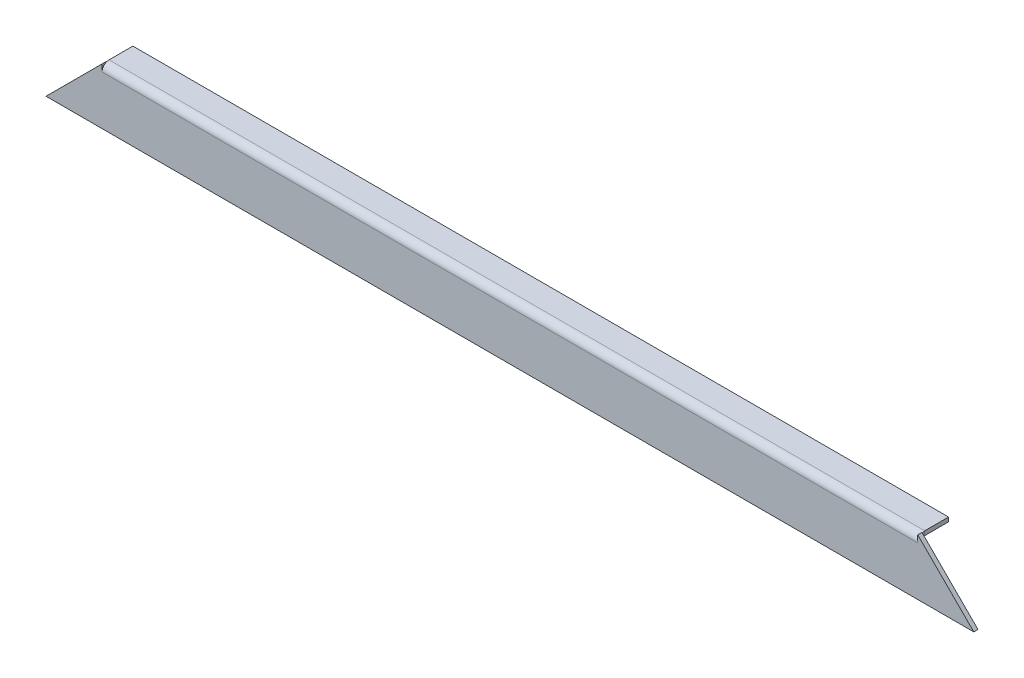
ISO-10303-21;
HEADER;
FILE_DESCRIPTION(('STEP AP214'),'2;1');
FILE_NAME('part.step','',(''),(''),'','','');
FILE_SCHEMA(('AUTOMOTIVE_DESIGN { 1 0 10303 214 1 1 1 1 }'));
ENDSEC;
DATA;
#1=APPLICATION_CONTEXT('core data for automotive mechanical design processes');
#2=APPLICATION_PROTOCOL_DEFINITION('international standard','automotive_design',2000,#1);
#3=PRODUCT_CONTEXT('',#1,'mechanical');
#4=PRODUCT('Part','Part','',(#3));
#5=PRODUCT_RELATED_PRODUCT_CATEGORY('part','',(#4));
#6=PRODUCT_DEFINITION_FORMATION('','',#4);
#7=PRODUCT_DEFINITION_CONTEXT('part definition',#1,'design');
#8=PRODUCT_DEFINITION('design','',#6,#7);
#9=PRODUCT_DEFINITION_SHAPE('','',#8);
#10=(LENGTH_UNIT() NAMED_UNIT(*) SI_UNIT(.MILLI.,.METRE.));
#11=(NAMED_UNIT(*) PLANE_ANGLE_UNIT() SI_UNIT($,.RADIAN.));
#12=(NAMED_UNIT(*) SI_UNIT($,.STERADIAN.) SOLID_ANGLE_UNIT());
#13=UNCERTAINTY_MEASURE_WITH_UNIT(LENGTH_MEASURE(1.E-05),#10,'distance_accuracy_value','');
#14=(GEOMETRIC_REPRESENTATION_CONTEXT(3) GLOBAL_UNCERTAINTY_ASSIGNED_CONTEXT((#13)) GLOBAL_UNIT_ASSIGNED_CONTEXT((#10,
#11,#12)) REPRESENTATION_CONTEXT('',''));
#15=CARTESIAN_POINT('',(0.,0.,0.));
#16=DIRECTION('',(0.,0.,1.));
#17=DIRECTION('',(1.,0.,0.));
#18=AXIS2_PLACEMENT_3D('',#15,#16,#17);
#19=CARTESIAN_POINT('',(145.5,-689.5,0.));
#20=DIRECTION('',(-1.,0.,0.));
#21=DIRECTION('',(0.,0.,1.));
#22=AXIS2_PLACEMENT_3D('',#19,#20,#21);
#23=PLANE('',#22);
#24=DIRECTION('',(0.,-1.,0.));
#25=VECTOR('',#24,1.);
#26=CARTESIAN_POINT('',(145.5,-689.5,0.));
#27=LINE('',#26,#25);
#28=CARTESIAN_POINT('',(145.5,-689.5,0.));
#29=VERTEX_POINT('',#28);
#30=CARTESIAN_POINT('',(145.5,-689.708712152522,0.));
#31=VERTEX_POINT('',#30);
#32=EDGE_CURVE('E206',#29,#31,#27,.T.);
#33=ORIENTED_EDGE('',*,*,#32,.T.);
#34=CARTESIAN_POINT('',(145.5,-692.,-1.));
#35=DIRECTION('',(1.,0.,0.));
#36=DIRECTION('',(0.,0.,-1.));
#37=AXIS2_PLACEMENT_3D('',#34,#35,#36);
#38=CIRCLE('',#37,2.49999999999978);
#39=CARTESIAN_POINT('',(145.5,-692.,1.5));
#40=VERTEX_POINT('',#39);
#41=EDGE_CURVE('E13',#31,#40,#38,.T.);
#42=ORIENTED_EDGE('',*,*,#41,.T.);
#43=DIRECTION('',(0.,-1.,0.));
#44=VECTOR('',#43,1.);
#45=CARTESIAN_POINT('',(145.5,0.,1.5));
#46=LINE('',#45,#44);
#47=CARTESIAN_POINT('',(145.5,-689.5,1.5));
#48=VERTEX_POINT('',#47);
#49=EDGE_CURVE('E213',#48,#40,#46,.T.);
#50=ORIENTED_EDGE('',*,*,#49,.F.);
#51=DIRECTION('',(0.,0.,-1.));
#52=VECTOR('',#51,1.);
#53=CARTESIAN_POINT('',(145.5,-689.5,1.5));
#54=LINE('',#53,#52);
#55=EDGE_CURVE('E233',#48,#29,#54,.T.);
#56=ORIENTED_EDGE('',*,*,#55,.T.);
#57=EDGE_LOOP('',(#33,#42,#50,#56));
#58=FACE_BOUND('',#57,.T.);
#59=ADVANCED_FACE('F58',(#58),#23,.T.);
#60=CARTESIAN_POINT('',(-145.499999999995,-692.,-2.22044604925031E-13));
#61=DIRECTION('',(1.,0.,0.));
#62=DIRECTION('',(0.,0.,-1.));
#63=AXIS2_PLACEMENT_3D('',#60,#61,#62);
#64=PLANE('',#63);
#65=DIRECTION('',(0.,1.,0.));
#66=VECTOR('',#65,1.);
#67=CARTESIAN_POINT('',(-145.499999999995,0.,1.5));
#68=LINE('',#67,#66);
#69=CARTESIAN_POINT('',(-145.499999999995,-692.,1.5));
#70=VERTEX_POINT('',#69);
#71=CARTESIAN_POINT('',(-145.499999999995,-689.5,1.5));
#72=VERTEX_POINT('',#71);
#73=EDGE_CURVE('E208',#70,#72,#68,.T.);
#74=ORIENTED_EDGE('',*,*,#73,.F.);
#75=CARTESIAN_POINT('',(-145.499999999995,-692.,-1.));
#76=DIRECTION('',(1.,0.,0.));
#77=DIRECTION('',(0.,0.,-1.));
#78=AXIS2_PLACEMENT_3D('',#75,#76,#77);
#79=CIRCLE('',#78,2.49999999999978);
#80=CARTESIAN_POINT('',(-145.499999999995,-689.708712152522,0.));
#81=VERTEX_POINT('',#80);
#82=EDGE_CURVE('E196',#70,#81,#79,.F.);
#83=ORIENTED_EDGE('',*,*,#82,.T.);
#84=DIRECTION('',(0.,1.,0.));
#85=VECTOR('',#84,1.);
#86=CARTESIAN_POINT('',(-145.499999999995,-692.,-2.22044604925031E-13));
#87=LINE('',#86,#85);
#88=CARTESIAN_POINT('',(-145.499999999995,-689.5,0.));
#89=VERTEX_POINT('',#88);
#90=EDGE_CURVE('E198',#81,#89,#87,.T.);
#91=ORIENTED_EDGE('',*,*,#90,.T.);
#92=DIRECTION('',(0.,0.,-1.));
#93=VECTOR('',#92,1.);
#94=CARTESIAN_POINT('',(-145.499999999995,-689.5,1.5));
#95=LINE('',#94,#93);
#96=EDGE_CURVE('E224',#72,#89,#95,.T.);
#97=ORIENTED_EDGE('',*,*,#96,.F.);
#98=EDGE_LOOP('',(#74,#83,#91,#97));
#99=FACE_BOUND('',#98,.T.);
#100=ADVANCED_FACE('F257',(#99),#64,.T.);
#101=CARTESIAN_POINT('',(0.,0.,1.5));
#102=DIRECTION('',(0.,0.,1.));
#103=DIRECTION('',(1.,0.,0.));
#104=AXIS2_PLACEMENT_3D('',#101,#102,#103);
#105=PLANE('',#104);
#106=DIRECTION('',(-0.707106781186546,0.707106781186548,0.));
#107=VECTOR('',#106,1.);
#108=CARTESIAN_POINT('',(145.5,-689.5,1.5));
#109=LINE('',#108,#107);
#110=CARTESIAN_POINT('',(165.5,-709.5,1.5));
#111=VERTEX_POINT('',#110);
#112=EDGE_CURVE('E222',#111,#48,#109,.T.);
#113=ORIENTED_EDGE('',*,*,#112,.T.);
#114=ORIENTED_EDGE('',*,*,#49,.T.);
#115=DIRECTION('',(1.,0.,0.));
#116=VECTOR('',#115,1.);
#117=CARTESIAN_POINT('',(145.5,-691.999999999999,1.49999999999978));
#118=LINE('',#117,#116);
#119=EDGE_CURVE('E150',#40,#70,#118,.F.);
#120=ORIENTED_EDGE('',*,*,#119,.T.);
#121=ORIENTED_EDGE('',*,*,#73,.T.);
#122=DIRECTION('',(-0.707106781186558,-0.707106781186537,0.));
#123=VECTOR('',#122,1.);
#124=CARTESIAN_POINT('',(-145.499999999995,-689.5,1.5));
#125=LINE('',#124,#123);
#126=CARTESIAN_POINT('',(-165.499999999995,-709.5,1.5));
#127=VERTEX_POINT('',#126);
#128=EDGE_CURVE('E216',#72,#127,#125,.T.);
#129=ORIENTED_EDGE('',*,*,#128,.T.);
#130=DIRECTION('',(1.,0.,0.));
#131=VECTOR('',#130,1.);
#132=CARTESIAN_POINT('',(-165.499999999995,-709.5,1.5));
#133=LINE('',#132,#131);
#134=EDGE_CURVE('E219',#127,#111,#133,.T.);
#135=ORIENTED_EDGE('',*,*,#134,.T.);
#136=EDGE_LOOP('',(#113,#114,#120,#121,#129,#135));
#137=FACE_BOUND('',#136,.T.);
#138=ADVANCED_FACE('F253',(#137),#105,.T.);
#139=CARTESIAN_POINT('',(0.,0.,0.));
#140=DIRECTION('',(0.,0.,1.));
#141=DIRECTION('',(1.,0.,0.));
#142=AXIS2_PLACEMENT_3D('',#139,#140,#141);
#143=PLANE('',#142);
#144=ORIENTED_EDGE('',*,*,#32,.F.);
#145=DIRECTION('',(-0.707106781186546,0.707106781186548,0.));
#146=VECTOR('',#145,1.);
#147=CARTESIAN_POINT('',(145.5,-689.5,0.));
#148=LINE('',#147,#146);
#149=CARTESIAN_POINT('',(165.5,-709.5,0.));
#150=VERTEX_POINT('',#149);
#151=EDGE_CURVE('E220',#150,#29,#148,.T.);
#152=ORIENTED_EDGE('',*,*,#151,.F.);
#153=DIRECTION('',(1.,0.,0.));
#154=VECTOR('',#153,1.);
#155=CARTESIAN_POINT('',(-165.499999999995,-709.5,0.));
#156=LINE('',#155,#154);
#157=CARTESIAN_POINT('',(-165.499999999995,-709.5,0.));
#158=VERTEX_POINT('',#157);
#159=EDGE_CURVE('E227',#158,#150,#156,.T.);
#160=ORIENTED_EDGE('',*,*,#159,.F.);
#161=DIRECTION('',(-0.707106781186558,-0.707106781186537,0.));
#162=VECTOR('',#161,1.);
#163=CARTESIAN_POINT('',(-145.499999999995,-689.5,0.));
#164=LINE('',#163,#162);
#165=EDGE_CURVE('E215',#89,#158,#164,.T.);
#166=ORIENTED_EDGE('',*,*,#165,.F.);
#167=ORIENTED_EDGE('',*,*,#90,.F.);
#168=CARTESIAN_POINT('',(-145.499999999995,-692.,0.));
#169=VERTEX_POINT('',#168);
#170=EDGE_CURVE('E209',#169,#81,#87,.T.);
#171=ORIENTED_EDGE('',*,*,#170,.F.);
#172=DIRECTION('',(1.,0.,0.));
#173=VECTOR('',#172,1.);
#174=CARTESIAN_POINT('',(145.5,-692.,-2.22044604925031E-13));
#175=LINE('',#174,#173);
#176=CARTESIAN_POINT('',(145.5,-692.,0.));
#177=VERTEX_POINT('',#176);
#178=EDGE_CURVE('E202',#177,#169,#175,.F.);
#179=ORIENTED_EDGE('',*,*,#178,.F.);
#180=EDGE_CURVE('E75',#31,#177,#27,.T.);
#181=ORIENTED_EDGE('',*,*,#180,.F.);
#182=EDGE_LOOP('',(#144,#152,#160,#166,#167,#171,#179,#181));
#183=FACE_BOUND('',#182,.T.);
#184=ADVANCED_FACE('F249',(#183),#143,.F.);
#185=CARTESIAN_POINT('',(-145.499999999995,-689.5,1.5));
#186=DIRECTION('',(0.707106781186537,-0.707106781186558,0.));
#187=DIRECTION('',(0.707106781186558,0.707106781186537,0.));
#188=AXIS2_PLACEMENT_3D('',#185,#186,#187);
#189=PLANE('',#188);
#190=ORIENTED_EDGE('',*,*,#165,.T.);
#191=DIRECTION('',(0.,0.,-1.));
#192=VECTOR('',#191,1.);
#193=CARTESIAN_POINT('',(-165.499999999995,-709.5,1.5));
#194=LINE('',#193,#192);
#195=EDGE_CURVE('E62',#127,#158,#194,.T.);
#196=ORIENTED_EDGE('',*,*,#195,.F.);
#197=ORIENTED_EDGE('',*,*,#128,.F.);
#198=ORIENTED_EDGE('',*,*,#96,.T.);
#199=EDGE_LOOP('',(#190,#196,#197,#198));
#200=FACE_BOUND('',#199,.T.);
#201=ADVANCED_FACE('F60',(#200),#189,.F.);
#202=CARTESIAN_POINT('',(-165.499999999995,-709.5,1.5));
#203=DIRECTION('',(0.,1.,0.));
#204=DIRECTION('',(0.,0.,1.));
#205=AXIS2_PLACEMENT_3D('',#202,#203,#204);
#206=PLANE('',#205);
#207=ORIENTED_EDGE('',*,*,#159,.T.);
#208=DIRECTION('',(0.,0.,-1.));
#209=VECTOR('',#208,1.);
#210=CARTESIAN_POINT('',(165.5,-709.5,1.5));
#211=LINE('',#210,#209);
#212=EDGE_CURVE('E235',#111,#150,#211,.T.);
#213=ORIENTED_EDGE('',*,*,#212,.F.);
#214=ORIENTED_EDGE('',*,*,#134,.F.);
#215=ORIENTED_EDGE('',*,*,#195,.T.);
#216=EDGE_LOOP('',(#207,#213,#214,#215));
#217=FACE_BOUND('',#216,.T.);
#218=ADVANCED_FACE('F244',(#217),#206,.F.);
#219=CARTESIAN_POINT('',(145.5,-689.5,1.5));
#220=DIRECTION('',(-0.707106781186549,-0.707106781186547,0.));
#221=DIRECTION('',(0.707106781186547,-0.707106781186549,0.));
#222=AXIS2_PLACEMENT_3D('',#219,#220,#221);
#223=PLANE('',#222);
#224=ORIENTED_EDGE('',*,*,#151,.T.);
#225=ORIENTED_EDGE('',*,*,#55,.F.);
#226=ORIENTED_EDGE('',*,*,#112,.F.);
#227=ORIENTED_EDGE('',*,*,#212,.T.);
#228=EDGE_LOOP('',(#224,#225,#226,#227));
#229=FACE_BOUND('',#228,.T.);
#230=ADVANCED_FACE('F251',(#229),#223,.F.);
#231=CARTESIAN_POINT('',(-145.499999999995,-692.,-1.));
#232=DIRECTION('',(-1.,0.,0.));
#233=DIRECTION('',(0.,0.,1.));
#234=AXIS2_PLACEMENT_3D('',#231,#232,#233);
#235=PLANE('',#234);
#236=CARTESIAN_POINT('',(-145.499999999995,-692.,-1.));
#237=DIRECTION('',(1.,0.,0.));
#238=DIRECTION('',(0.,0.,-1.));
#239=AXIS2_PLACEMENT_3D('',#236,#237,#238);
#240=CIRCLE('',#239,0.999999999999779);
#241=CARTESIAN_POINT('',(-145.499999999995,-691.,-1.));
#242=VERTEX_POINT('',#241);
#243=EDGE_CURVE('E151',#169,#242,#240,.F.);
#244=ORIENTED_EDGE('',*,*,#243,.F.);
#245=ORIENTED_EDGE('',*,*,#170,.T.);
#246=CARTESIAN_POINT('',(-145.499999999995,-689.5,-1.));
#247=VERTEX_POINT('',#246);
#248=EDGE_CURVE('E195',#81,#247,#79,.F.);
#249=ORIENTED_EDGE('',*,*,#248,.T.);
#250=DIRECTION('',(0.,1.,0.));
#251=VECTOR('',#250,1.);
#252=CARTESIAN_POINT('',(-145.499999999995,-689.5,-1.));
#253=LINE('',#252,#251);
#254=EDGE_CURVE('E192',#242,#247,#253,.T.);
#255=ORIENTED_EDGE('',*,*,#254,.F.);
#256=EDGE_LOOP('',(#244,#245,#249,#255));
#257=FACE_BOUND('',#256,.T.);
#258=ADVANCED_FACE('F260',(#257),#235,.T.);
#259=CARTESIAN_POINT('',(145.5,-692.,-1.));
#260=DIRECTION('',(-1.,0.,0.));
#261=DIRECTION('',(0.,0.,1.));
#262=AXIS2_PLACEMENT_3D('',#259,#260,#261);
#263=PLANE('',#262);
#264=CARTESIAN_POINT('',(145.5,-689.5,-1.));
#265=VERTEX_POINT('',#264);
#266=EDGE_CURVE('E68',#265,#31,#38,.T.);
#267=ORIENTED_EDGE('',*,*,#266,.T.);
#268=ORIENTED_EDGE('',*,*,#180,.T.);
#269=CARTESIAN_POINT('',(145.5,-692.,-1.));
#270=DIRECTION('',(1.,0.,0.));
#271=DIRECTION('',(0.,0.,-1.));
#272=AXIS2_PLACEMENT_3D('',#269,#270,#271);
#273=CIRCLE('',#272,0.999999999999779);
#274=CARTESIAN_POINT('',(145.5,-691.,-1.));
#275=VERTEX_POINT('',#274);
#276=EDGE_CURVE('E157',#275,#177,#273,.T.);
#277=ORIENTED_EDGE('',*,*,#276,.F.);
#278=DIRECTION('',(0.,1.,0.));
#279=VECTOR('',#278,1.);
#280=CARTESIAN_POINT('',(145.5,-691.,-1.));
#281=LINE('',#280,#279);
#282=EDGE_CURVE('E154',#275,#265,#281,.T.);
#283=ORIENTED_EDGE('',*,*,#282,.T.);
#284=EDGE_LOOP('',(#267,#268,#277,#283));
#285=FACE_BOUND('',#284,.T.);
#286=ADVANCED_FACE('F155',(#285),#263,.F.);
#287=CARTESIAN_POINT('',(145.5,-692.,-1.));
#288=DIRECTION('',(1.,0.,0.));
#289=DIRECTION('',(0.,1.,0.));
#290=AXIS2_PLACEMENT_3D('',#287,#288,#289);
#291=CYLINDRICAL_SURFACE('',#290,2.49999999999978);
#292=ORIENTED_EDGE('',*,*,#119,.F.);
#293=ORIENTED_EDGE('',*,*,#41,.F.);
#294=ORIENTED_EDGE('',*,*,#266,.F.);
#295=DIRECTION('',(1.,0.,0.));
#296=VECTOR('',#295,1.);
#297=CARTESIAN_POINT('',(7.89173995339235E-13,-689.5,-1.));
#298=LINE('',#297,#296);
#299=EDGE_CURVE('E147',#247,#265,#298,.T.);
#300=ORIENTED_EDGE('',*,*,#299,.F.);
#301=ORIENTED_EDGE('',*,*,#248,.F.);
#302=ORIENTED_EDGE('',*,*,#82,.F.);
#303=EDGE_LOOP('',(#292,#293,#294,#300,#301,#302));
#304=FACE_BOUND('',#303,.T.);
#305=ADVANCED_FACE('F144',(#304),#291,.T.);
#306=CARTESIAN_POINT('',(145.5,-692.,-1.));
#307=DIRECTION('',(1.,0.,0.));
#308=DIRECTION('',(0.,1.,0.));
#309=AXIS2_PLACEMENT_3D('',#306,#307,#308);
#310=CYLINDRICAL_SURFACE('',#309,0.999999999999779);
#311=ORIENTED_EDGE('',*,*,#178,.T.);
#312=ORIENTED_EDGE('',*,*,#243,.T.);
#313=DIRECTION('',(-1.,0.,0.));
#314=VECTOR('',#313,1.);
#315=CARTESIAN_POINT('',(-145.499999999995,-691.,-1.));
#316=LINE('',#315,#314);
#317=EDGE_CURVE('E162',#242,#275,#316,.F.);
#318=ORIENTED_EDGE('',*,*,#317,.T.);
#319=ORIENTED_EDGE('',*,*,#276,.T.);
#320=EDGE_LOOP('',(#311,#312,#318,#319));
#321=FACE_BOUND('',#320,.T.);
#322=ADVANCED_FACE('F262',(#321),#310,.F.);
#323=CARTESIAN_POINT('',(145.5,-689.5,0.));
#324=DIRECTION('',(1.,0.,0.));
#325=DIRECTION('',(0.,1.,0.));
#326=AXIS2_PLACEMENT_3D('',#323,#324,#325);
#327=PLANE('',#326);
#328=DIRECTION('',(0.,0.,1.));
#329=VECTOR('',#328,1.);
#330=CARTESIAN_POINT('',(145.5,-689.5,0.));
#331=LINE('',#330,#329);
#332=CARTESIAN_POINT('',(145.5,-689.5,-9.5));
#333=VERTEX_POINT('',#332);
#334=EDGE_CURVE('E169',#333,#265,#331,.T.);
#335=ORIENTED_EDGE('',*,*,#334,.T.);
#336=ORIENTED_EDGE('',*,*,#282,.F.);
#337=DIRECTION('',(0.,0.,-1.));
#338=VECTOR('',#337,1.);
#339=CARTESIAN_POINT('',(145.5,-691.,0.));
#340=LINE('',#339,#338);
#341=CARTESIAN_POINT('',(145.5,-691.,-9.50000000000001));
#342=VERTEX_POINT('',#341);
#343=EDGE_CURVE('E185',#342,#275,#340,.F.);
#344=ORIENTED_EDGE('',*,*,#343,.F.);
#345=DIRECTION('',(0.,-1.,0.));
#346=VECTOR('',#345,1.);
#347=CARTESIAN_POINT('',(145.5,-689.5,-9.5));
#348=LINE('',#347,#346);
#349=EDGE_CURVE('E174',#333,#342,#348,.T.);
#350=ORIENTED_EDGE('',*,*,#349,.F.);
#351=EDGE_LOOP('',(#335,#336,#344,#350));
#352=FACE_BOUND('',#351,.T.);
#353=ADVANCED_FACE('F173',(#352),#327,.T.);
#354=CARTESIAN_POINT('',(-145.499999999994,-689.5,-9.5));
#355=DIRECTION('',(-1.,0.,0.));
#356=DIRECTION('',(0.,0.,1.));
#357=AXIS2_PLACEMENT_3D('',#354,#355,#356);
#358=PLANE('',#357);
#359=DIRECTION('',(0.,0.,1.));
#360=VECTOR('',#359,1.);
#361=CARTESIAN_POINT('',(-145.499999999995,-691.,-1.19027594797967E-11));
#362=LINE('',#361,#360);
#363=CARTESIAN_POINT('',(-145.499999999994,-691.,-9.50000000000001));
#364=VERTEX_POINT('',#363);
#365=EDGE_CURVE('E171',#242,#364,#362,.F.);
#366=ORIENTED_EDGE('',*,*,#365,.F.);
#367=ORIENTED_EDGE('',*,*,#254,.T.);
#368=DIRECTION('',(0.,0.,-1.));
#369=VECTOR('',#368,1.);
#370=CARTESIAN_POINT('',(-145.499999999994,-689.5,-9.5));
#371=LINE('',#370,#369);
#372=CARTESIAN_POINT('',(-145.499999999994,-689.5,-9.5));
#373=VERTEX_POINT('',#372);
#374=EDGE_CURVE('E170',#247,#373,#371,.T.);
#375=ORIENTED_EDGE('',*,*,#374,.T.);
#376=DIRECTION('',(0.,-1.,0.));
#377=VECTOR('',#376,1.);
#378=CARTESIAN_POINT('',(-145.499999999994,-689.5,-9.5));
#379=LINE('',#378,#377);
#380=EDGE_CURVE('E176',#373,#364,#379,.T.);
#381=ORIENTED_EDGE('',*,*,#380,.T.);
#382=EDGE_LOOP('',(#366,#367,#375,#381));
#383=FACE_BOUND('',#382,.T.);
#384=ADVANCED_FACE('F268',(#383),#358,.T.);
#385=CARTESIAN_POINT('',(7.89173995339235E-13,-689.5,0.));
#386=DIRECTION('',(0.,1.,0.));
#387=DIRECTION('',(-1.,0.,0.));
#388=AXIS2_PLACEMENT_3D('',#385,#386,#387);
#389=PLANE('',#388);
#390=ORIENTED_EDGE('',*,*,#374,.F.);
#391=ORIENTED_EDGE('',*,*,#299,.T.);
#392=ORIENTED_EDGE('',*,*,#334,.F.);
#393=DIRECTION('',(1.,0.,0.));
#394=VECTOR('',#393,1.);
#395=CARTESIAN_POINT('',(145.5,-689.5,-9.5));
#396=LINE('',#395,#394);
#397=EDGE_CURVE('E177',#373,#333,#396,.T.);
#398=ORIENTED_EDGE('',*,*,#397,.F.);
#399=EDGE_LOOP('',(#390,#391,#392,#398));
#400=FACE_BOUND('',#399,.T.);
#401=ADVANCED_FACE('F167',(#400),#389,.T.);
#402=CARTESIAN_POINT('',(7.90890835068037E-13,-691.,0.));
#403=DIRECTION('',(0.,1.,0.));
#404=DIRECTION('',(-1.,0.,0.));
#405=AXIS2_PLACEMENT_3D('',#402,#403,#404);
#406=PLANE('',#405);
#407=ORIENTED_EDGE('',*,*,#317,.F.);
#408=ORIENTED_EDGE('',*,*,#365,.T.);
#409=DIRECTION('',(-1.,0.,0.));
#410=VECTOR('',#409,1.);
#411=CARTESIAN_POINT('',(7.90890835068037E-13,-691.,-9.50000000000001));
#412=LINE('',#411,#410);
#413=EDGE_CURVE('E187',#364,#342,#412,.F.);
#414=ORIENTED_EDGE('',*,*,#413,.T.);
#415=ORIENTED_EDGE('',*,*,#343,.T.);
#416=EDGE_LOOP('',(#407,#408,#414,#415));
#417=FACE_BOUND('',#416,.T.);
#418=ADVANCED_FACE('F266',(#417),#406,.F.);
#419=CARTESIAN_POINT('',(145.5,-689.5,-9.5));
#420=DIRECTION('',(0.,0.,-1.));
#421=DIRECTION('',(0.,1.,0.));
#422=AXIS2_PLACEMENT_3D('',#419,#420,#421);
#423=PLANE('',#422);
#424=ORIENTED_EDGE('',*,*,#413,.F.);
#425=ORIENTED_EDGE('',*,*,#380,.F.);
#426=ORIENTED_EDGE('',*,*,#397,.T.);
#427=ORIENTED_EDGE('',*,*,#349,.T.);
#428=EDGE_LOOP('',(#424,#425,#426,#427));
#429=FACE_BOUND('',#428,.T.);
#430=ADVANCED_FACE('F272',(#429),#423,.T.);
#431=CLOSED_SHELL('',(#59,#100,#138,#184,#201,#218,#230,#258,#286,#305,#322,#353,#384,#401,#418,#430));
#432=MANIFOLD_SOLID_BREP('B2',#431);
#433=ADVANCED_BREP_SHAPE_REPRESENTATION('',(#18,#432),#14);
#434=SHAPE_DEFINITION_REPRESENTATION(#9,#433);
ENDSEC;
END-ISO-10303-21;
